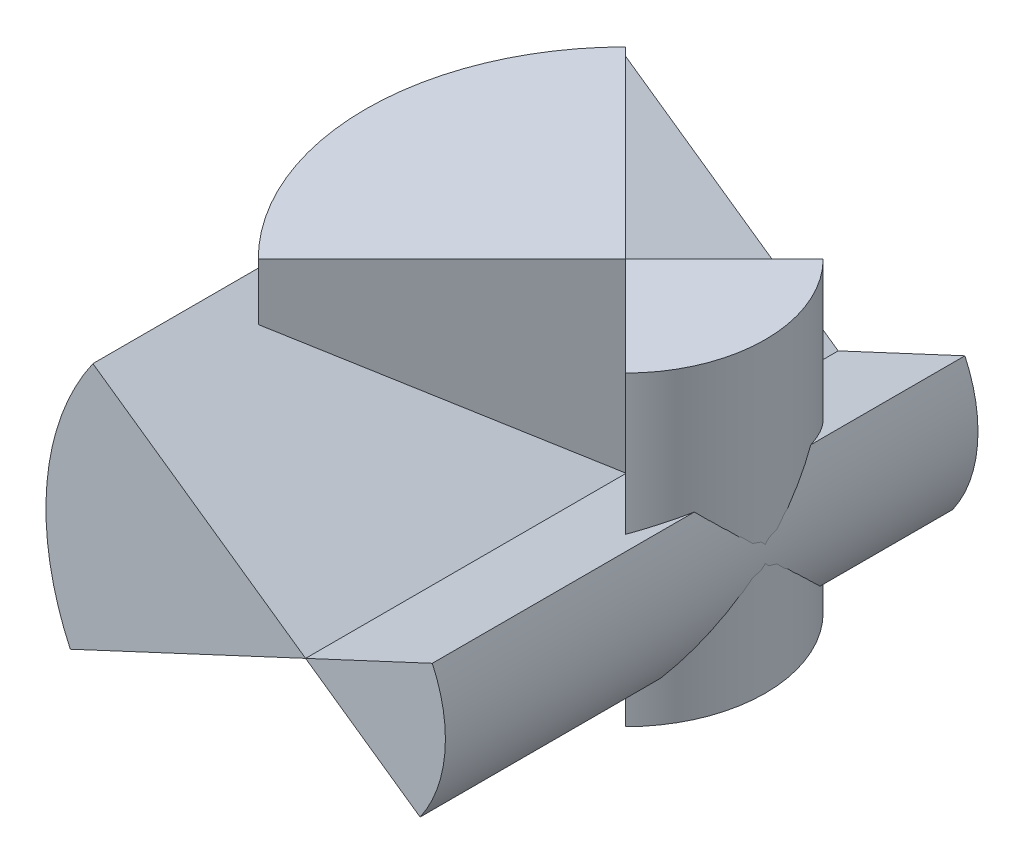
from build123d import *

# Parameters (mm, degrees)
EXTRUDE_1_DEPTH   = 115
EXTRUDE_1_2_DEPTH = 115
EXTRUDE_2_DEPTH   = 200
EXTRUDE_2_2_DEPTH = 200


with BuildPart() as part:
    # Sketch 1 → Extrude 1 (new, symmetric)
    with BuildSketch(Plane(origin=(0, 24.420227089, 0), x_dir=(1, 0, 0), z_dir=(0, 1, 0))):
        with BuildLine():
            Line((-138.158738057, -97.385822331), (-0.272915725, 40.5))
            Line((-0.272915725, 40.5), (-138.158738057, 178.385822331))
            ThreePointArc((-138.158738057, 178.385822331), (-195.272915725, 40.5), (-138.158738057, -97.385822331))
        make_face()
    extrude(amount=EXTRUDE_1_DEPTH, both=True)


with BuildPart() as body_2:
    # Sketch 1 → Extrude 1 2 (new, symmetric)
    with BuildSketch(Plane(origin=(0, 24.420227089, 0), x_dir=(1, 0, 0), z_dir=(0, 1, 0))):
        with BuildLine():
            Line((73.973296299, 114.746212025), (-0.272915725, 40.5))
            Line((-0.272915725, 40.5), (73.973296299, -33.746212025))
            ThreePointArc((73.973296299, -33.746212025), (104.727084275, 40.5), (73.973296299, 114.746212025))
        make_face()
    extrude(amount=EXTRUDE_1_2_DEPTH, both=True)


with BuildPart() as body_3:
    # Sketch 2 → Extrude 2 (new, symmetric)
    with BuildSketch(Plane.XY):
        with BuildLine():
            Line((-176.730018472, -82.410561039), (0, 0))
            Line((0, 0), (-159.734648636, 111.847405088))
            ThreePointArc((-159.734648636, 111.847405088), (-194.257966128, 16.995369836), (-176.730018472, -82.410561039))
        make_face()
    extrude(amount=EXTRUDE_2_DEPTH, both=True)


with BuildPart() as body_4:
    # Sketch 2 → Extrude 2 2 (new, symmetric)
    with BuildSketch(Plane.XY):
        with BuildLine():
            Line((95.162317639, 44.374917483), (0, 0))
            Line((0, 0), (86.01096465, -60.225525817))
            ThreePointArc((86.01096465, -60.225525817), (104.6004433, -9.151352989), (95.162317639, 44.374917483))
        make_face()
    extrude(amount=EXTRUDE_2_2_DEPTH, both=True)


solid = Compound([part.part, body_2.part, body_3.part, body_4.part])
